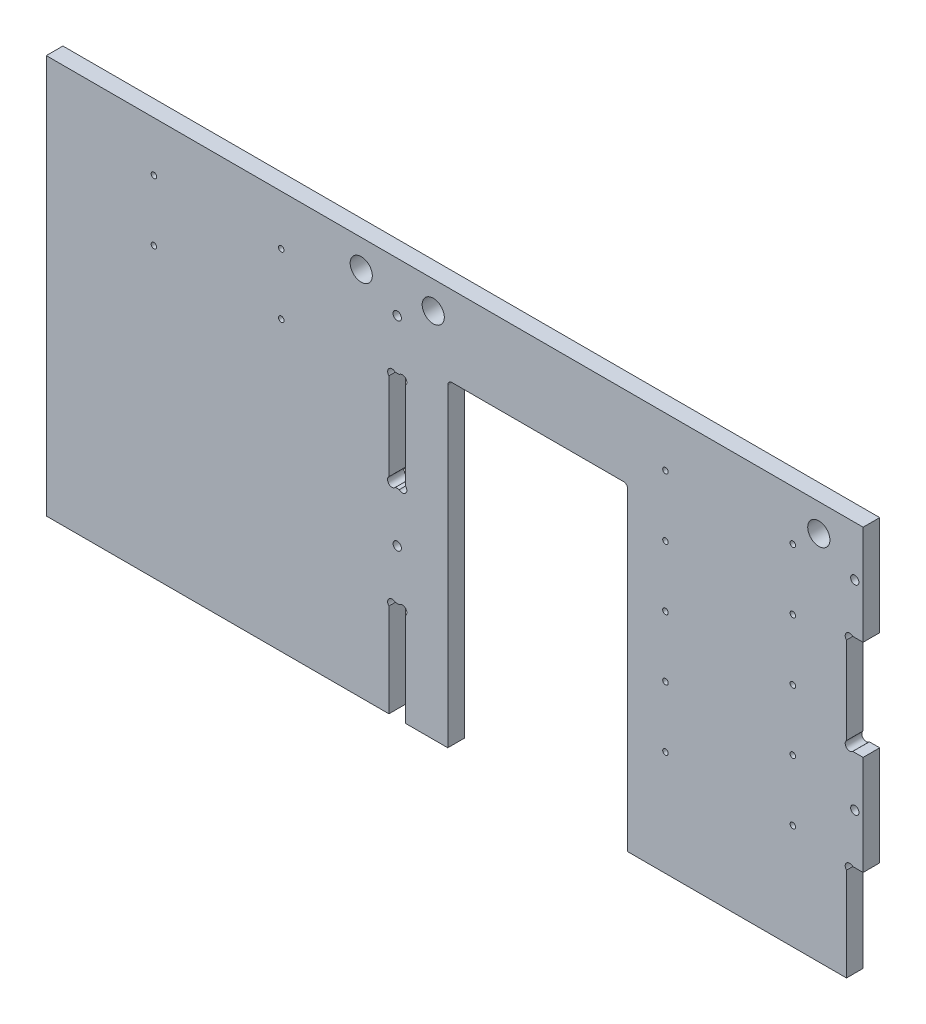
from build123d import *

# Parameters (mm, degrees)
EXTRUSION1_DEPTH        = 6
ESQUISSE2_R             = 1.6
ENL_V_MAT_EXTRU_1_DEPTH = 329.324534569
ENL_V_MAT_EXTRU_2_DEPTH = 329.324534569
ESQUISSE5_W             = 6
ESQUISSE5_H             = 36
ENL_V_MAT_EXTRU_3_DEPTH = 329.324534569
ESQUISSE6_R             = 1.6
ENL_V_MAT_EXTRU_4_DEPTH = 329.324534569
ESQUISSE7_R             = 4
ESQUISSE7_R_2           = 1
ESQUISSE7_R_3           = 1.5
ENL_V_MAT_EXTRU_5_DEPTH = 329.324534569


with BuildPart() as part:
    # Esquisse1 → Extrusion1 (new body)
    with BuildSketch(Plane.XY):
        Polygon((0, 0), (289, 0), (289, 36), (295, 36), (295, 72), (289, 72), (289, 108), (295, 108), (295, 144), (0, 144), align=None)
    extrude(amount=EXTRUSION1_DEPTH)

    # Esquisse2 → Enl_v. mat.-Extru.1 (cut, through all)
    with BuildSketch(Plane.XY.offset(6)):
        with Locations((290.13137085, 106.86862915)):
            Circle(ESQUISSE2_R)
        with Locations((290.13137085, 73.13137085)):
            Circle(ESQUISSE2_R)
        with Locations((290.13137085, 34.86862915)):
            Circle(ESQUISSE2_R)
    extrude(amount=-ENL_V_MAT_EXTRU_1_DEPTH, mode=Mode.SUBTRACT)

    # Esquisse3 → Enl_v. mat.-Extru.2 (cut, through all)
    with BuildSketch(Plane.XY.offset(6)):
        with BuildLine():
            Line((145, 0), (210, 0))
            Line((210, 0), (210, 113.5))
            ThreePointArc((210, 113.5), (209.560660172, 114.560660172), (208.5, 115))
            Line((208.5, 115), (146.5, 115))
            ThreePointArc((146.5, 115), (145.439339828, 114.560660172), (145, 113.5))
            Line((145, 113.5), (145, 0))
        make_face()
    extrude(amount=-ENL_V_MAT_EXTRU_2_DEPTH, mode=Mode.SUBTRACT)

    # Esquisse5 → Enl_v. mat.-Extru.3 (cut, through all)
    with BuildSketch(Plane.XY.offset(6)):
        with Locations((126.75, 90)):
            Rectangle(ESQUISSE5_W, ESQUISSE5_H)
        with Locations((126.75, 18)):
            Rectangle(ESQUISSE5_W, ESQUISSE5_H)
    extrude(amount=-ENL_V_MAT_EXTRU_3_DEPTH, mode=Mode.SUBTRACT)

    # Esquisse6 → Enl_v. mat.-Extru.4 (cut, through all)
    with BuildSketch(Plane.XY.offset(6)):
        with Locations((124.88137085, 106.86862915)):
            Circle(ESQUISSE6_R)
        with Locations((128.61862915, 106.86862915)):
            Circle(ESQUISSE6_R)
        with Locations((128.61862915, 73.13137085)):
            Circle(ESQUISSE6_R)
        with Locations((124.85470082, 73.014241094)):
            Circle(ESQUISSE6_R)
        with Locations((124.88137085, 34.86862915)):
            Circle(ESQUISSE6_R)
        with Locations((128.61862915, 34.86862915)):
            Circle(ESQUISSE6_R)
    extrude(amount=-ENL_V_MAT_EXTRU_4_DEPTH, mode=Mode.SUBTRACT)

    # Esquisse7 → Enl_v. mat.-Extru.5 (cut, through all)
    with BuildSketch(Plane.XY.offset(6)):
        with Locations((279, 134)):
            Circle(ESQUISSE7_R)
        with Locations((139.75, 134)):
            Circle(ESQUISSE7_R)
        with Locations((113.75, 134)):
            Circle(ESQUISSE7_R)
        with Locations((223.620911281, 126)):
            Circle(ESQUISSE7_R_2)
        with Locations((269.620911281, 126)):
            Circle(ESQUISSE7_R_2)
        with Locations((269.620911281, 104)):
            Circle(ESQUISSE7_R_2)
        with Locations((269.620911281, 82)):
            Circle(ESQUISSE7_R_2)
        with Locations((269.620911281, 60)):
            Circle(ESQUISSE7_R_2)
        with Locations((269.620911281, 38)):
            Circle(ESQUISSE7_R_2)
        with Locations((223.620911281, 38)):
            Circle(ESQUISSE7_R_2)
        with Locations((223.620911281, 60)):
            Circle(ESQUISSE7_R_2)
        with Locations((223.620911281, 82)):
            Circle(ESQUISSE7_R_2)
        with Locations((223.620911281, 104)):
            Circle(ESQUISSE7_R_2)
        with Locations((84.875, 126)):
            Circle(ESQUISSE7_R_2)
        with Locations((84.875, 104)):
            Circle(ESQUISSE7_R_2)
        with Locations((38.875, 126)):
            Circle(ESQUISSE7_R_2)
        with Locations((38.875, 104)):
            Circle(ESQUISSE7_R_2)
        with Locations((292, 126)):
            Circle(ESQUISSE7_R_3)
        with Locations((292, 54)):
            Circle(ESQUISSE7_R_3)
        with Locations((126.75, 54)):
            Circle(ESQUISSE7_R_3)
        with Locations((126.75, 126)):
            Circle(ESQUISSE7_R_3)
    extrude(amount=-ENL_V_MAT_EXTRU_5_DEPTH, mode=Mode.SUBTRACT)


solid = part.part
